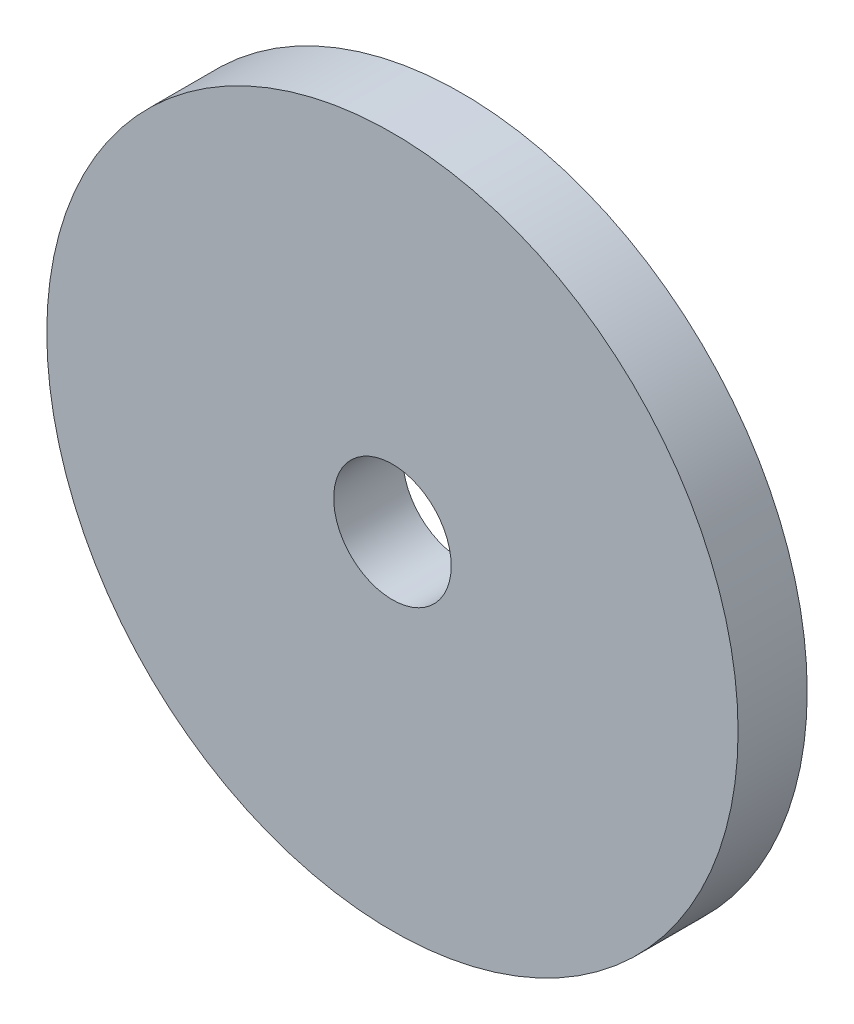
from build123d import *

# Parameters (mm, degrees)
ESQUISSE1_R          = 25
ESQUISSE1_R_2        = 4.25
BASE_EXTRUSION_DEPTH = 5


with BuildPart() as part:
    # Esquisse1 → Base-Extrusion (new body)
    with BuildSketch(Plane.XY):
        Circle(ESQUISSE1_R)
        Circle(ESQUISSE1_R_2, mode=Mode.SUBTRACT)
    extrude(amount=BASE_EXTRUSION_DEPTH)


solid = part.part
